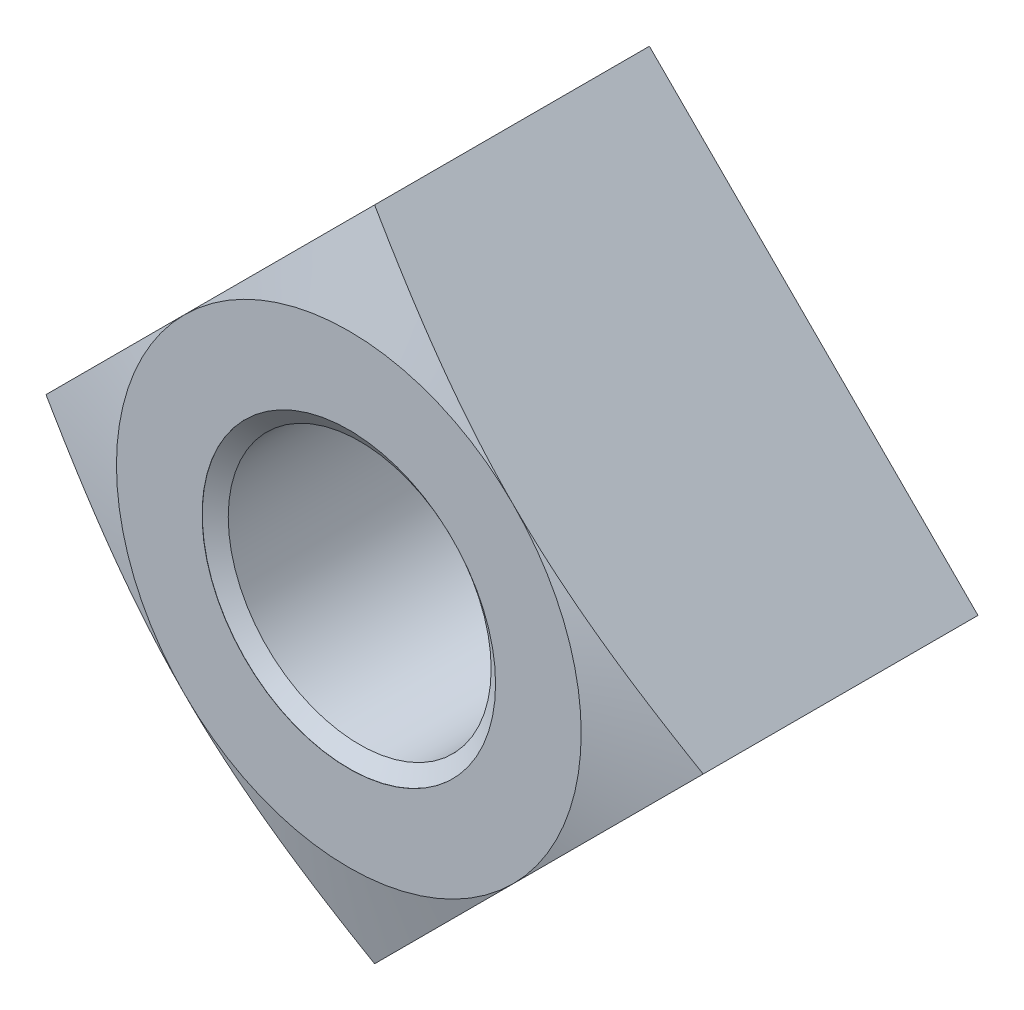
from build123d import *

# Parameters (mm, degrees)
BASENUT_START = -39.0144
BASENUTSKE_R  = 17.06626
BASENUT_DEPTH = 39.0144


with BuildPart() as part:
    # BaseNutSke → BaseNut (new body)
    with BuildSketch(Plane.XY.offset(BASENUT_START)):
        Polygon((42.656216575, 0), (0, 42.656216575), (-42.656216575, 0), (0, -42.656216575), align=None)
        Circle(BASENUTSKE_R, mode=Mode.SUBTRACT)
    extrude(amount=BASENUT_DEPTH)

    # EndChamferSketch → EndChamfer (revolve, cut)
    with BuildSketch(Plane(origin=(0, 0, 0), x_dir=(0, 0, -1), z_dir=(1, 0, 0)), mode=Mode.PRIVATE) as endchamfer_sk:
        Polygon((38.99154, 19.05), (37.464174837, 16.867886), (39.0144, 16.867886), (39.0144, 19.05), align=None)
        Polygon((0, 19.05), (0.02286, 19.05), (1.550225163, 16.867886), (0, 16.867886), align=None)
    revolve(endchamfer_sk.sketch.rotate(Axis((0, 0, -25.037505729), (0, 0, -1)), 90), axis=Axis((0, 0, -25.037505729), (0, 0, -1)), mode=Mode.SUBTRACT)

    # Sketch2 → Single-Chamfer (revolve, cut)
    with BuildSketch(Plane(origin=(0, 0, 0), x_dir=(0, 0, -1), z_dir=(1, 0, 0))):
        Polygon((-12.7, 30.1625), (0, 30.1625), (6.750636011, 55.356216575), (-12.7, 55.356216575), align=None)
    revolve(axis=Axis((0, 0, 0), (0, 0, -1)), mode=Mode.SUBTRACT)


solid = part.part
